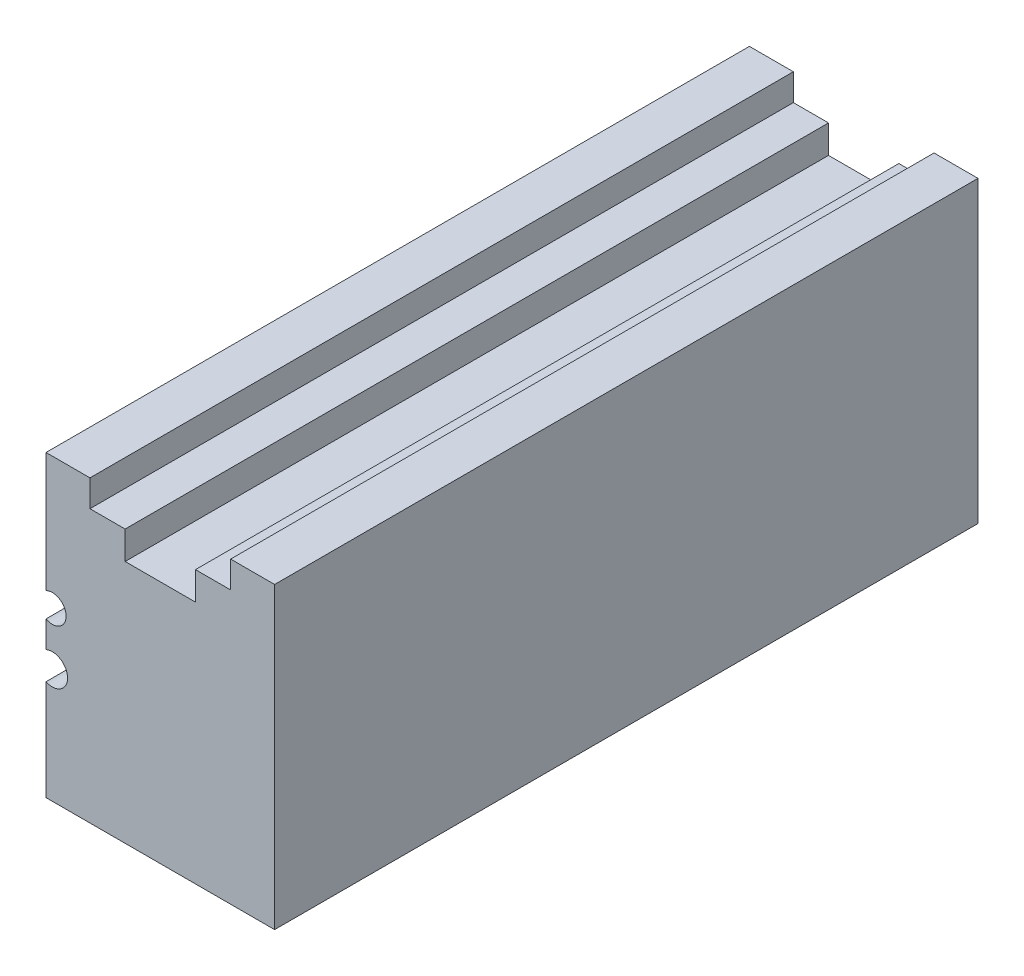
ISO-10303-21;
HEADER;
FILE_DESCRIPTION(('STEP AP214'),'2;1');
FILE_NAME('part.step','',(''),(''),'','','');
FILE_SCHEMA(('AUTOMOTIVE_DESIGN { 1 0 10303 214 1 1 1 1 }'));
ENDSEC;
DATA;
#1=APPLICATION_CONTEXT('core data for automotive mechanical design processes');
#2=APPLICATION_PROTOCOL_DEFINITION('international standard','automotive_design',2000,#1);
#3=PRODUCT_CONTEXT('',#1,'mechanical');
#4=PRODUCT('Part','Part','',(#3));
#5=PRODUCT_RELATED_PRODUCT_CATEGORY('part','',(#4));
#6=PRODUCT_DEFINITION_FORMATION('','',#4);
#7=PRODUCT_DEFINITION_CONTEXT('part definition',#1,'design');
#8=PRODUCT_DEFINITION('design','',#6,#7);
#9=PRODUCT_DEFINITION_SHAPE('','',#8);
#10=(LENGTH_UNIT() NAMED_UNIT(*) SI_UNIT(.MILLI.,.METRE.));
#11=(NAMED_UNIT(*) PLANE_ANGLE_UNIT() SI_UNIT($,.RADIAN.));
#12=(NAMED_UNIT(*) SI_UNIT($,.STERADIAN.) SOLID_ANGLE_UNIT());
#13=UNCERTAINTY_MEASURE_WITH_UNIT(LENGTH_MEASURE(1.E-05),#10,'distance_accuracy_value','');
#14=(GEOMETRIC_REPRESENTATION_CONTEXT(3) GLOBAL_UNCERTAINTY_ASSIGNED_CONTEXT((#13)) GLOBAL_UNIT_ASSIGNED_CONTEXT((#10,
#11,#12)) REPRESENTATION_CONTEXT('',''));
#15=CARTESIAN_POINT('',(0.,0.,0.));
#16=DIRECTION('',(0.,0.,1.));
#17=DIRECTION('',(1.,0.,0.));
#18=AXIS2_PLACEMENT_3D('',#15,#16,#17);
#19=CARTESIAN_POINT('',(0.,53.975,-127.));
#20=DIRECTION('',(0.,1.,0.));
#21=DIRECTION('',(0.,0.,1.));
#22=AXIS2_PLACEMENT_3D('',#19,#20,#21);
#23=PLANE('',#22);
#24=DIRECTION('',(0.,0.,1.));
#25=VECTOR('',#24,1.);
#26=CARTESIAN_POINT('',(7.9375,53.975,-127.));
#27=LINE('',#26,#25);
#28=CARTESIAN_POINT('',(7.9375,53.975,-127.));
#29=VERTEX_POINT('',#28);
#30=CARTESIAN_POINT('',(7.9375,53.975,0.));
#31=VERTEX_POINT('',#30);
#32=EDGE_CURVE('E373',#29,#31,#27,.T.);
#33=ORIENTED_EDGE('',*,*,#32,.F.);
#34=DIRECTION('',(-1.,0.,0.));
#35=VECTOR('',#34,1.);
#36=CARTESIAN_POINT('',(0.,53.975,-127.));
#37=LINE('',#36,#35);
#38=CARTESIAN_POINT('',(0.,53.975,-127.));
#39=VERTEX_POINT('',#38);
#40=EDGE_CURVE('E412',#29,#39,#37,.T.);
#41=ORIENTED_EDGE('',*,*,#40,.T.);
#42=DIRECTION('',(0.,0.,1.));
#43=VECTOR('',#42,1.);
#44=CARTESIAN_POINT('',(0.,53.975,-127.));
#45=LINE('',#44,#43);
#46=CARTESIAN_POINT('',(0.,53.975,0.));
#47=VERTEX_POINT('',#46);
#48=EDGE_CURVE('E435',#39,#47,#45,.T.);
#49=ORIENTED_EDGE('',*,*,#48,.T.);
#50=DIRECTION('',(-1.,0.,0.));
#51=VECTOR('',#50,1.);
#52=CARTESIAN_POINT('',(0.,53.975,0.));
#53=LINE('',#52,#51);
#54=EDGE_CURVE('E431',#31,#47,#53,.T.);
#55=ORIENTED_EDGE('',*,*,#54,.F.);
#56=EDGE_LOOP('',(#33,#41,#49,#55));
#57=FACE_BOUND('',#56,.T.);
#58=ADVANCED_FACE('F42',(#57),#23,.T.);
#59=CARTESIAN_POINT('',(0.,0.,-127.));
#60=DIRECTION('',(-1.,0.,0.));
#61=DIRECTION('',(0.,0.,1.));
#62=AXIS2_PLACEMENT_3D('',#59,#60,#61);
#63=PLANE('',#62);
#64=CARTESIAN_POINT('',(0.,11.938,-120.015));
#65=DIRECTION('',(-1.,0.,0.));
#66=DIRECTION('',(0.,0.,1.));
#67=AXIS2_PLACEMENT_3D('',#64,#65,#66);
#68=CIRCLE('',#67,3.048);
#69=CARTESIAN_POINT('',(0.,11.938,-116.967));
#70=VERTEX_POINT('',#69);
#71=EDGE_CURVE('E198',#70,#70,#68,.T.);
#72=ORIENTED_EDGE('',*,*,#71,.F.);
#73=EDGE_LOOP('',(#72));
#74=FACE_BOUND('',#73,.T.);
#75=CARTESIAN_POINT('',(0.,11.938,-6.985));
#76=DIRECTION('',(-1.,0.,0.));
#77=DIRECTION('',(0.,0.,1.));
#78=AXIS2_PLACEMENT_3D('',#75,#76,#77);
#79=CIRCLE('',#78,3.048);
#80=CARTESIAN_POINT('',(0.,11.938,-3.937));
#81=VERTEX_POINT('',#80);
#82=EDGE_CURVE('E188',#81,#81,#79,.T.);
#83=ORIENTED_EDGE('',*,*,#82,.F.);
#84=EDGE_LOOP('',(#83));
#85=FACE_BOUND('',#84,.T.);
#86=CARTESIAN_POINT('',(0.,44.069,-63.5));
#87=DIRECTION('',(-1.,0.,0.));
#88=DIRECTION('',(0.,0.,1.));
#89=AXIS2_PLACEMENT_3D('',#86,#87,#88);
#90=CIRCLE('',#89,3.048);
#91=CARTESIAN_POINT('',(0.,44.069,-60.452));
#92=VERTEX_POINT('',#91);
#93=EDGE_CURVE('E209',#92,#92,#90,.T.);
#94=ORIENTED_EDGE('',*,*,#93,.F.);
#95=EDGE_LOOP('',(#94));
#96=FACE_BOUND('',#95,.T.);
#97=DIRECTION('',(0.,0.,1.));
#98=VECTOR('',#97,1.);
#99=CARTESIAN_POINT('',(0.,18.1303508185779,-50.8));
#100=LINE('',#99,#98);
#101=CARTESIAN_POINT('',(0.,18.1303508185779,-50.8));
#102=VERTEX_POINT('',#101);
#103=CARTESIAN_POINT('',(0.,18.1303508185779,0.));
#104=VERTEX_POINT('',#103);
#105=EDGE_CURVE('E58',#102,#104,#100,.T.);
#106=ORIENTED_EDGE('',*,*,#105,.F.);
#107=DIRECTION('',(0.,1.,0.));
#108=VECTOR('',#107,1.);
#109=CARTESIAN_POINT('',(0.,0.,-50.8));
#110=LINE('',#109,#108);
#111=CARTESIAN_POINT('',(0.,23.1446491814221,-50.8));
#112=VERTEX_POINT('',#111);
#113=EDGE_CURVE('E11',#102,#112,#110,.T.);
#114=ORIENTED_EDGE('',*,*,#113,.T.);
#115=DIRECTION('',(0.,0.,1.));
#116=VECTOR('',#115,1.);
#117=CARTESIAN_POINT('',(0.,23.1446491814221,-50.8));
#118=LINE('',#117,#116);
#119=CARTESIAN_POINT('',(0.,23.1446491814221,0.));
#120=VERTEX_POINT('',#119);
#121=EDGE_CURVE('E225',#120,#112,#118,.F.);
#122=ORIENTED_EDGE('',*,*,#121,.F.);
#123=DIRECTION('',(0.,-1.,0.));
#124=VECTOR('',#123,1.);
#125=CARTESIAN_POINT('',(0.,0.,0.));
#126=LINE('',#125,#124);
#127=CARTESIAN_POINT('',(0.,27.9508709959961,0.));
#128=VERTEX_POINT('',#127);
#129=EDGE_CURVE('E423',#128,#120,#126,.T.);
#130=ORIENTED_EDGE('',*,*,#129,.F.);
#131=DIRECTION('',(0.,0.,1.));
#132=VECTOR('',#131,1.);
#133=CARTESIAN_POINT('',(0.,27.9508709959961,-50.8));
#134=LINE('',#133,#132);
#135=CARTESIAN_POINT('',(0.,27.9508709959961,-50.8));
#136=VERTEX_POINT('',#135);
#137=EDGE_CURVE('E66',#136,#128,#134,.T.);
#138=ORIENTED_EDGE('',*,*,#137,.F.);
#139=DIRECTION('',(0.,1.,0.));
#140=VECTOR('',#139,1.);
#141=CARTESIAN_POINT('',(0.,0.,-50.8));
#142=LINE('',#141,#140);
#143=CARTESIAN_POINT('',(0.,32.3741290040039,-50.8));
#144=VERTEX_POINT('',#143);
#145=EDGE_CURVE('E451',#136,#144,#142,.T.);
#146=ORIENTED_EDGE('',*,*,#145,.T.);
#147=DIRECTION('',(0.,0.,1.));
#148=VECTOR('',#147,1.);
#149=CARTESIAN_POINT('',(0.,32.3741290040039,-50.8));
#150=LINE('',#149,#148);
#151=CARTESIAN_POINT('',(0.,32.3741290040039,0.));
#152=VERTEX_POINT('',#151);
#153=EDGE_CURVE('E234',#152,#144,#150,.F.);
#154=ORIENTED_EDGE('',*,*,#153,.F.);
#155=EDGE_CURVE('E418',#47,#152,#126,.T.);
#156=ORIENTED_EDGE('',*,*,#155,.F.);
#157=ORIENTED_EDGE('',*,*,#48,.F.);
#158=DIRECTION('',(0.,-1.,0.));
#159=VECTOR('',#158,1.);
#160=CARTESIAN_POINT('',(0.,0.,-127.));
#161=LINE('',#160,#159);
#162=CARTESIAN_POINT('',(0.,0.,-127.));
#163=VERTEX_POINT('',#162);
#164=EDGE_CURVE('E399',#39,#163,#161,.T.);
#165=ORIENTED_EDGE('',*,*,#164,.T.);
#166=DIRECTION('',(0.,0.,1.));
#167=VECTOR('',#166,1.);
#168=CARTESIAN_POINT('',(0.,0.,-127.));
#169=LINE('',#168,#167);
#170=CARTESIAN_POINT('',(0.,0.,0.));
#171=VERTEX_POINT('',#170);
#172=EDGE_CURVE('E417',#163,#171,#169,.T.);
#173=ORIENTED_EDGE('',*,*,#172,.T.);
#174=EDGE_CURVE('E376',#104,#171,#126,.T.);
#175=ORIENTED_EDGE('',*,*,#174,.F.);
#176=EDGE_LOOP('',(#106,#114,#122,#130,#138,#146,#154,#156,#157,#165,#173,#175));
#177=FACE_BOUND('',#176,.T.);
#178=ADVANCED_FACE('F44',(#74,#85,#96,#177),#63,.T.);
#179=DIRECTION('',(0.,0.,1.));
#180=VECTOR('',#179,1.);
#181=CARTESIAN_POINT('',(33.3375,53.975,-127.));
#182=LINE('',#181,#180);
#183=CARTESIAN_POINT('',(33.3375,53.975,-127.));
#184=VERTEX_POINT('',#183);
#185=CARTESIAN_POINT('',(33.3375,53.975,0.));
#186=VERTEX_POINT('',#185);
#187=EDGE_CURVE('E377',#184,#186,#182,.T.);
#188=ORIENTED_EDGE('',*,*,#187,.T.);
#189=CARTESIAN_POINT('',(41.275,53.975,0.));
#190=VERTEX_POINT('',#189);
#191=EDGE_CURVE('E404',#190,#186,#53,.T.);
#192=ORIENTED_EDGE('',*,*,#191,.F.);
#193=DIRECTION('',(0.,0.,1.));
#194=VECTOR('',#193,1.);
#195=CARTESIAN_POINT('',(41.275,53.975,-127.));
#196=LINE('',#195,#194);
#197=CARTESIAN_POINT('',(41.275,53.975,-127.));
#198=VERTEX_POINT('',#197);
#199=EDGE_CURVE('E440',#198,#190,#196,.T.);
#200=ORIENTED_EDGE('',*,*,#199,.F.);
#201=EDGE_CURVE('E413',#198,#184,#37,.T.);
#202=ORIENTED_EDGE('',*,*,#201,.T.);
#203=EDGE_LOOP('',(#188,#192,#200,#202));
#204=FACE_BOUND('',#203,.T.);
#205=ADVANCED_FACE('F493',(#204),#23,.T.);
#206=CARTESIAN_POINT('',(41.275,0.,-127.));
#207=DIRECTION('',(1.,0.,0.));
#208=DIRECTION('',(0.,0.,-1.));
#209=AXIS2_PLACEMENT_3D('',#206,#207,#208);
#210=PLANE('',#209);
#211=DIRECTION('',(0.,1.,0.));
#212=VECTOR('',#211,1.);
#213=CARTESIAN_POINT('',(41.275,0.,0.));
#214=LINE('',#213,#212);
#215=CARTESIAN_POINT('',(41.275,0.,0.));
#216=VERTEX_POINT('',#215);
#217=EDGE_CURVE('E427',#216,#190,#214,.T.);
#218=ORIENTED_EDGE('',*,*,#217,.F.);
#219=DIRECTION('',(0.,0.,1.));
#220=VECTOR('',#219,1.);
#221=CARTESIAN_POINT('',(41.275,0.,-127.));
#222=LINE('',#221,#220);
#223=CARTESIAN_POINT('',(41.275,0.,-127.));
#224=VERTEX_POINT('',#223);
#225=EDGE_CURVE('E443',#224,#216,#222,.T.);
#226=ORIENTED_EDGE('',*,*,#225,.F.);
#227=DIRECTION('',(0.,1.,0.));
#228=VECTOR('',#227,1.);
#229=CARTESIAN_POINT('',(41.275,0.,-127.));
#230=LINE('',#229,#228);
#231=EDGE_CURVE('E408',#224,#198,#230,.T.);
#232=ORIENTED_EDGE('',*,*,#231,.T.);
#233=ORIENTED_EDGE('',*,*,#199,.T.);
#234=EDGE_LOOP('',(#218,#226,#232,#233));
#235=FACE_BOUND('',#234,.T.);
#236=ADVANCED_FACE('F501',(#235),#210,.T.);
#237=CARTESIAN_POINT('',(0.,0.,-127.));
#238=DIRECTION('',(0.,-1.,0.));
#239=DIRECTION('',(0.,0.,-1.));
#240=AXIS2_PLACEMENT_3D('',#237,#238,#239);
#241=PLANE('',#240);
#242=CARTESIAN_POINT('',(4.7625,0.,-38.1));
#243=DIRECTION('',(0.,-1.,0.));
#244=DIRECTION('',(0.,0.,-1.));
#245=AXIS2_PLACEMENT_3D('',#242,#243,#244);
#246=CIRCLE('',#245,3.81);
#247=CARTESIAN_POINT('',(4.7625,0.,-41.91));
#248=VERTEX_POINT('',#247);
#249=EDGE_CURVE('E239',#248,#248,#246,.T.);
#250=ORIENTED_EDGE('',*,*,#249,.F.);
#251=EDGE_LOOP('',(#250));
#252=FACE_BOUND('',#251,.T.);
#253=CARTESIAN_POINT('',(36.5125,0.,-38.1));
#254=DIRECTION('',(0.,-1.,0.));
#255=DIRECTION('',(0.,0.,-1.));
#256=AXIS2_PLACEMENT_3D('',#253,#254,#255);
#257=CIRCLE('',#256,3.81);
#258=CARTESIAN_POINT('',(36.5125,0.,-41.91));
#259=VERTEX_POINT('',#258);
#260=EDGE_CURVE('E251',#259,#259,#257,.T.);
#261=ORIENTED_EDGE('',*,*,#260,.F.);
#262=EDGE_LOOP('',(#261));
#263=FACE_BOUND('',#262,.T.);
#264=CARTESIAN_POINT('',(36.5125,0.,-88.9));
#265=DIRECTION('',(0.,-1.,0.));
#266=DIRECTION('',(0.,0.,-1.));
#267=AXIS2_PLACEMENT_3D('',#264,#265,#266);
#268=CIRCLE('',#267,3.81);
#269=CARTESIAN_POINT('',(36.5125,0.,-92.71));
#270=VERTEX_POINT('',#269);
#271=EDGE_CURVE('E263',#270,#270,#268,.T.);
#272=ORIENTED_EDGE('',*,*,#271,.F.);
#273=EDGE_LOOP('',(#272));
#274=FACE_BOUND('',#273,.T.);
#275=CARTESIAN_POINT('',(4.7625,0.,-88.9));
#276=DIRECTION('',(0.,-1.,0.));
#277=DIRECTION('',(0.,0.,-1.));
#278=AXIS2_PLACEMENT_3D('',#275,#276,#277);
#279=CIRCLE('',#278,3.81);
#280=CARTESIAN_POINT('',(4.7625,0.,-92.71));
#281=VERTEX_POINT('',#280);
#282=EDGE_CURVE('E275',#281,#281,#279,.T.);
#283=ORIENTED_EDGE('',*,*,#282,.F.);
#284=EDGE_LOOP('',(#283));
#285=FACE_BOUND('',#284,.T.);
#286=CARTESIAN_POINT('',(4.7625,0.,-63.5));
#287=DIRECTION('',(0.,-1.,0.));
#288=DIRECTION('',(0.,0.,-1.));
#289=AXIS2_PLACEMENT_3D('',#286,#287,#288);
#290=CIRCLE('',#289,2.413);
#291=CARTESIAN_POINT('',(4.7625,0.,-65.913));
#292=VERTEX_POINT('',#291);
#293=EDGE_CURVE('E293',#292,#292,#290,.T.);
#294=ORIENTED_EDGE('',*,*,#293,.F.);
#295=EDGE_LOOP('',(#294));
#296=FACE_BOUND('',#295,.T.);
#297=CARTESIAN_POINT('',(36.5125,0.,-63.5));
#298=DIRECTION('',(0.,-1.,0.));
#299=DIRECTION('',(0.,0.,-1.));
#300=AXIS2_PLACEMENT_3D('',#297,#298,#299);
#301=CIRCLE('',#300,2.41299999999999);
#302=CARTESIAN_POINT('',(36.5125,0.,-65.913));
#303=VERTEX_POINT('',#302);
#304=EDGE_CURVE('E301',#303,#303,#301,.T.);
#305=ORIENTED_EDGE('',*,*,#304,.F.);
#306=EDGE_LOOP('',(#305));
#307=FACE_BOUND('',#306,.T.);
#308=CARTESIAN_POINT('',(20.6375,0.,-101.6));
#309=DIRECTION('',(0.,-1.,0.));
#310=DIRECTION('',(0.,0.,-1.));
#311=AXIS2_PLACEMENT_3D('',#308,#309,#310);
#312=CIRCLE('',#311,2.413);
#313=CARTESIAN_POINT('',(20.6375,0.,-104.013));
#314=VERTEX_POINT('',#313);
#315=EDGE_CURVE('E287',#314,#314,#312,.T.);
#316=ORIENTED_EDGE('',*,*,#315,.F.);
#317=EDGE_LOOP('',(#316));
#318=FACE_BOUND('',#317,.T.);
#319=CARTESIAN_POINT('',(20.6375,0.,-25.4));
#320=DIRECTION('',(0.,-1.,0.));
#321=DIRECTION('',(0.,0.,-1.));
#322=AXIS2_PLACEMENT_3D('',#319,#320,#321);
#323=CIRCLE('',#322,2.413);
#324=CARTESIAN_POINT('',(20.6375,0.,-27.813));
#325=VERTEX_POINT('',#324);
#326=EDGE_CURVE('E292',#325,#325,#323,.T.);
#327=ORIENTED_EDGE('',*,*,#326,.F.);
#328=EDGE_LOOP('',(#327));
#329=FACE_BOUND('',#328,.T.);
#330=DIRECTION('',(1.,0.,0.));
#331=VECTOR('',#330,1.);
#332=CARTESIAN_POINT('',(0.,0.,0.));
#333=LINE('',#332,#331);
#334=EDGE_CURVE('E422',#171,#216,#333,.T.);
#335=ORIENTED_EDGE('',*,*,#334,.F.);
#336=ORIENTED_EDGE('',*,*,#172,.F.);
#337=DIRECTION('',(1.,0.,0.));
#338=VECTOR('',#337,1.);
#339=CARTESIAN_POINT('',(0.,0.,-127.));
#340=LINE('',#339,#338);
#341=EDGE_CURVE('E403',#163,#224,#340,.T.);
#342=ORIENTED_EDGE('',*,*,#341,.T.);
#343=ORIENTED_EDGE('',*,*,#225,.T.);
#344=EDGE_LOOP('',(#335,#336,#342,#343));
#345=FACE_BOUND('',#344,.T.);
#346=ADVANCED_FACE('F506',(#252,#263,#274,#285,#296,#307,#318,#329,#345),#241,.T.);
#347=CARTESIAN_POINT('',(0.,0.,-127.));
#348=DIRECTION('',(0.,0.,-1.));
#349=DIRECTION('',(-1.,0.,0.));
#350=AXIS2_PLACEMENT_3D('',#347,#348,#349);
#351=PLANE('',#350);
#352=DIRECTION('',(0.,-1.,0.));
#353=VECTOR('',#352,1.);
#354=CARTESIAN_POINT('',(7.9375,53.975,-127.));
#355=LINE('',#354,#353);
#356=CARTESIAN_POINT('',(7.9375,49.149,-127.));
#357=VERTEX_POINT('',#356);
#358=EDGE_CURVE('E320',#29,#357,#355,.T.);
#359=ORIENTED_EDGE('',*,*,#358,.T.);
#360=DIRECTION('',(1.,0.,0.));
#361=VECTOR('',#360,1.);
#362=CARTESIAN_POINT('',(7.9375,49.149,-127.));
#363=LINE('',#362,#361);
#364=CARTESIAN_POINT('',(14.2875,49.149,-127.));
#365=VERTEX_POINT('',#364);
#366=EDGE_CURVE('E324',#357,#365,#363,.T.);
#367=ORIENTED_EDGE('',*,*,#366,.T.);
#368=DIRECTION('',(0.,-1.,0.));
#369=VECTOR('',#368,1.);
#370=CARTESIAN_POINT('',(14.2875,49.149,-127.));
#371=LINE('',#370,#369);
#372=CARTESIAN_POINT('',(14.2875,44.069,-127.));
#373=VERTEX_POINT('',#372);
#374=EDGE_CURVE('E329',#365,#373,#371,.T.);
#375=ORIENTED_EDGE('',*,*,#374,.T.);
#376=DIRECTION('',(1.,0.,0.));
#377=VECTOR('',#376,1.);
#378=CARTESIAN_POINT('',(14.2875,44.069,-127.));
#379=LINE('',#378,#377);
#380=CARTESIAN_POINT('',(26.9875,44.069,-127.));
#381=VERTEX_POINT('',#380);
#382=EDGE_CURVE('E333',#373,#381,#379,.T.);
#383=ORIENTED_EDGE('',*,*,#382,.T.);
#384=DIRECTION('',(0.,1.,0.));
#385=VECTOR('',#384,1.);
#386=CARTESIAN_POINT('',(26.9875,49.149,-127.));
#387=LINE('',#386,#385);
#388=CARTESIAN_POINT('',(26.9875,49.149,-127.));
#389=VERTEX_POINT('',#388);
#390=EDGE_CURVE('E337',#381,#389,#387,.T.);
#391=ORIENTED_EDGE('',*,*,#390,.T.);
#392=DIRECTION('',(1.,0.,0.));
#393=VECTOR('',#392,1.);
#394=CARTESIAN_POINT('',(26.9875,49.149,-127.));
#395=LINE('',#394,#393);
#396=CARTESIAN_POINT('',(33.3375,49.149,-127.));
#397=VERTEX_POINT('',#396);
#398=EDGE_CURVE('E341',#389,#397,#395,.T.);
#399=ORIENTED_EDGE('',*,*,#398,.T.);
#400=DIRECTION('',(0.,1.,0.));
#401=VECTOR('',#400,1.);
#402=CARTESIAN_POINT('',(33.3375,53.975,-127.));
#403=LINE('',#402,#401);
#404=EDGE_CURVE('E345',#397,#184,#403,.T.);
#405=ORIENTED_EDGE('',*,*,#404,.T.);
#406=ORIENTED_EDGE('',*,*,#201,.F.);
#407=ORIENTED_EDGE('',*,*,#231,.F.);
#408=ORIENTED_EDGE('',*,*,#341,.F.);
#409=ORIENTED_EDGE('',*,*,#164,.F.);
#410=ORIENTED_EDGE('',*,*,#40,.F.);
#411=EDGE_LOOP('',(#359,#367,#375,#383,#391,#399,#405,#406,#407,#408,#409,#410));
#412=FACE_BOUND('',#411,.T.);
#413=ADVANCED_FACE('F518',(#412),#351,.T.);
#414=CARTESIAN_POINT('',(0.,0.,0.));
#415=DIRECTION('',(0.,0.,-1.));
#416=DIRECTION('',(-1.,0.,0.));
#417=AXIS2_PLACEMENT_3D('',#414,#415,#416);
#418=PLANE('',#417);
#419=ORIENTED_EDGE('',*,*,#129,.T.);
#420=CARTESIAN_POINT('',(1.143,20.6375,0.));
#421=DIRECTION('',(0.,0.,-1.));
#422=DIRECTION('',(-1.,0.,0.));
#423=AXIS2_PLACEMENT_3D('',#420,#421,#422);
#424=CIRCLE('',#423,2.75540305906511);
#425=EDGE_CURVE('E51',#120,#104,#424,.T.);
#426=ORIENTED_EDGE('',*,*,#425,.T.);
#427=ORIENTED_EDGE('',*,*,#174,.T.);
#428=ORIENTED_EDGE('',*,*,#334,.T.);
#429=ORIENTED_EDGE('',*,*,#217,.T.);
#430=ORIENTED_EDGE('',*,*,#191,.T.);
#431=DIRECTION('',(0.,1.,0.));
#432=VECTOR('',#431,1.);
#433=CARTESIAN_POINT('',(33.3375,53.975,0.));
#434=LINE('',#433,#432);
#435=CARTESIAN_POINT('',(33.3375,49.149,0.));
#436=VERTEX_POINT('',#435);
#437=EDGE_CURVE('E325',#436,#186,#434,.T.);
#438=ORIENTED_EDGE('',*,*,#437,.F.);
#439=DIRECTION('',(1.,0.,0.));
#440=VECTOR('',#439,1.);
#441=CARTESIAN_POINT('',(26.9875,49.149,0.));
#442=LINE('',#441,#440);
#443=CARTESIAN_POINT('',(26.9875,49.149,0.));
#444=VERTEX_POINT('',#443);
#445=EDGE_CURVE('E367',#444,#436,#442,.T.);
#446=ORIENTED_EDGE('',*,*,#445,.F.);
#447=DIRECTION('',(0.,1.,0.));
#448=VECTOR('',#447,1.);
#449=CARTESIAN_POINT('',(26.9875,49.149,0.));
#450=LINE('',#449,#448);
#451=CARTESIAN_POINT('',(26.9875,44.069,0.));
#452=VERTEX_POINT('',#451);
#453=EDGE_CURVE('E363',#452,#444,#450,.T.);
#454=ORIENTED_EDGE('',*,*,#453,.F.);
#455=DIRECTION('',(1.,0.,0.));
#456=VECTOR('',#455,1.);
#457=CARTESIAN_POINT('',(14.2875,44.069,0.));
#458=LINE('',#457,#456);
#459=CARTESIAN_POINT('',(14.2875,44.069,0.));
#460=VERTEX_POINT('',#459);
#461=EDGE_CURVE('E360',#460,#452,#458,.T.);
#462=ORIENTED_EDGE('',*,*,#461,.F.);
#463=DIRECTION('',(0.,-1.,0.));
#464=VECTOR('',#463,1.);
#465=CARTESIAN_POINT('',(14.2875,49.149,0.));
#466=LINE('',#465,#464);
#467=CARTESIAN_POINT('',(14.2875,49.149,0.));
#468=VERTEX_POINT('',#467);
#469=EDGE_CURVE('E356',#468,#460,#466,.T.);
#470=ORIENTED_EDGE('',*,*,#469,.F.);
#471=DIRECTION('',(1.,0.,0.));
#472=VECTOR('',#471,1.);
#473=CARTESIAN_POINT('',(7.9375,49.149,0.));
#474=LINE('',#473,#472);
#475=CARTESIAN_POINT('',(7.9375,49.149,0.));
#476=VERTEX_POINT('',#475);
#477=EDGE_CURVE('E352',#476,#468,#474,.T.);
#478=ORIENTED_EDGE('',*,*,#477,.F.);
#479=DIRECTION('',(0.,-1.,0.));
#480=VECTOR('',#479,1.);
#481=CARTESIAN_POINT('',(7.9375,53.975,0.));
#482=LINE('',#481,#480);
#483=EDGE_CURVE('E316',#31,#476,#482,.T.);
#484=ORIENTED_EDGE('',*,*,#483,.F.);
#485=ORIENTED_EDGE('',*,*,#54,.T.);
#486=ORIENTED_EDGE('',*,*,#155,.T.);
#487=CARTESIAN_POINT('',(1.143,30.1625,0.));
#488=DIRECTION('',(0.,0.,-1.));
#489=DIRECTION('',(-1.,0.,0.));
#490=AXIS2_PLACEMENT_3D('',#487,#488,#489);
#491=CIRCLE('',#490,2.48952843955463);
#492=EDGE_CURVE('E439',#152,#128,#491,.T.);
#493=ORIENTED_EDGE('',*,*,#492,.T.);
#494=EDGE_LOOP('',(#419,#426,#427,#428,#429,#430,#438,#446,#454,#462,#470,#478,#484,#485,#486,#493));
#495=FACE_BOUND('',#494,.T.);
#496=ADVANCED_FACE('F458',(#495),#418,.F.);
#497=CARTESIAN_POINT('',(7.9375,53.975,-127.));
#498=DIRECTION('',(-1.,0.,0.));
#499=DIRECTION('',(0.,0.,1.));
#500=AXIS2_PLACEMENT_3D('',#497,#498,#499);
#501=PLANE('',#500);
#502=ORIENTED_EDGE('',*,*,#483,.T.);
#503=DIRECTION('',(0.,0.,1.));
#504=VECTOR('',#503,1.);
#505=CARTESIAN_POINT('',(7.9375,49.149,-127.));
#506=LINE('',#505,#504);
#507=EDGE_CURVE('E349',#357,#476,#506,.T.);
#508=ORIENTED_EDGE('',*,*,#507,.F.);
#509=ORIENTED_EDGE('',*,*,#358,.F.);
#510=ORIENTED_EDGE('',*,*,#32,.T.);
#511=EDGE_LOOP('',(#502,#508,#509,#510));
#512=FACE_BOUND('',#511,.T.);
#513=ADVANCED_FACE('F539',(#512),#501,.F.);
#514=CARTESIAN_POINT('',(33.3375,53.975,-127.));
#515=DIRECTION('',(1.,0.,0.));
#516=DIRECTION('',(0.,0.,-1.));
#517=AXIS2_PLACEMENT_3D('',#514,#515,#516);
#518=PLANE('',#517);
#519=ORIENTED_EDGE('',*,*,#437,.T.);
#520=ORIENTED_EDGE('',*,*,#187,.F.);
#521=ORIENTED_EDGE('',*,*,#404,.F.);
#522=DIRECTION('',(0.,0.,1.));
#523=VECTOR('',#522,1.);
#524=CARTESIAN_POINT('',(33.3375,49.149,-127.));
#525=LINE('',#524,#523);
#526=EDGE_CURVE('E381',#397,#436,#525,.T.);
#527=ORIENTED_EDGE('',*,*,#526,.T.);
#528=EDGE_LOOP('',(#519,#520,#521,#527));
#529=FACE_BOUND('',#528,.T.);
#530=ADVANCED_FACE('F520',(#529),#518,.F.);
#531=CARTESIAN_POINT('',(26.9875,49.149,-127.));
#532=DIRECTION('',(0.,-1.,0.));
#533=DIRECTION('',(0.,0.,-1.));
#534=AXIS2_PLACEMENT_3D('',#531,#532,#533);
#535=PLANE('',#534);
#536=ORIENTED_EDGE('',*,*,#445,.T.);
#537=ORIENTED_EDGE('',*,*,#526,.F.);
#538=ORIENTED_EDGE('',*,*,#398,.F.);
#539=DIRECTION('',(0.,0.,1.));
#540=VECTOR('',#539,1.);
#541=CARTESIAN_POINT('',(26.9875,49.149,-127.));
#542=LINE('',#541,#540);
#543=EDGE_CURVE('E384',#389,#444,#542,.T.);
#544=ORIENTED_EDGE('',*,*,#543,.T.);
#545=EDGE_LOOP('',(#536,#537,#538,#544));
#546=FACE_BOUND('',#545,.T.);
#547=ADVANCED_FACE('F522',(#546),#535,.F.);
#548=CARTESIAN_POINT('',(26.9875,49.149,-127.));
#549=DIRECTION('',(1.,0.,0.));
#550=DIRECTION('',(0.,0.,-1.));
#551=AXIS2_PLACEMENT_3D('',#548,#549,#550);
#552=PLANE('',#551);
#553=ORIENTED_EDGE('',*,*,#453,.T.);
#554=ORIENTED_EDGE('',*,*,#543,.F.);
#555=ORIENTED_EDGE('',*,*,#390,.F.);
#556=DIRECTION('',(0.,0.,1.));
#557=VECTOR('',#556,1.);
#558=CARTESIAN_POINT('',(26.9875,44.069,-127.));
#559=LINE('',#558,#557);
#560=EDGE_CURVE('E387',#381,#452,#559,.T.);
#561=ORIENTED_EDGE('',*,*,#560,.T.);
#562=EDGE_LOOP('',(#553,#554,#555,#561));
#563=FACE_BOUND('',#562,.T.);
#564=ADVANCED_FACE('F527',(#563),#552,.F.);
#565=CARTESIAN_POINT('',(14.2875,44.069,-127.));
#566=DIRECTION('',(0.,-1.,0.));
#567=DIRECTION('',(0.,0.,-1.));
#568=AXIS2_PLACEMENT_3D('',#565,#566,#567);
#569=PLANE('',#568);
#570=ORIENTED_EDGE('',*,*,#461,.T.);
#571=ORIENTED_EDGE('',*,*,#560,.F.);
#572=ORIENTED_EDGE('',*,*,#382,.F.);
#573=DIRECTION('',(0.,0.,1.));
#574=VECTOR('',#573,1.);
#575=CARTESIAN_POINT('',(14.2875,44.069,-127.));
#576=LINE('',#575,#574);
#577=EDGE_CURVE('E390',#373,#460,#576,.T.);
#578=ORIENTED_EDGE('',*,*,#577,.T.);
#579=EDGE_LOOP('',(#570,#571,#572,#578));
#580=FACE_BOUND('',#579,.T.);
#581=ADVANCED_FACE('F531',(#580),#569,.F.);
#582=CARTESIAN_POINT('',(14.2875,49.149,-127.));
#583=DIRECTION('',(-1.,0.,0.));
#584=DIRECTION('',(0.,0.,1.));
#585=AXIS2_PLACEMENT_3D('',#582,#583,#584);
#586=PLANE('',#585);
#587=ORIENTED_EDGE('',*,*,#469,.T.);
#588=ORIENTED_EDGE('',*,*,#577,.F.);
#589=ORIENTED_EDGE('',*,*,#374,.F.);
#590=DIRECTION('',(0.,0.,1.));
#591=VECTOR('',#590,1.);
#592=CARTESIAN_POINT('',(14.2875,49.149,-127.));
#593=LINE('',#592,#591);
#594=EDGE_CURVE('E393',#365,#468,#593,.T.);
#595=ORIENTED_EDGE('',*,*,#594,.T.);
#596=EDGE_LOOP('',(#587,#588,#589,#595));
#597=FACE_BOUND('',#596,.T.);
#598=ADVANCED_FACE('F534',(#597),#586,.F.);
#599=CARTESIAN_POINT('',(7.9375,49.149,-127.));
#600=DIRECTION('',(0.,-1.,0.));
#601=DIRECTION('',(1.,0.,0.));
#602=AXIS2_PLACEMENT_3D('',#599,#600,#601);
#603=PLANE('',#602);
#604=ORIENTED_EDGE('',*,*,#477,.T.);
#605=ORIENTED_EDGE('',*,*,#594,.F.);
#606=ORIENTED_EDGE('',*,*,#366,.F.);
#607=ORIENTED_EDGE('',*,*,#507,.T.);
#608=EDGE_LOOP('',(#604,#605,#606,#607));
#609=FACE_BOUND('',#608,.T.);
#610=ADVANCED_FACE('F536',(#609),#603,.F.);
#611=CARTESIAN_POINT('',(20.6375,6.35,-25.4));
#612=DIRECTION('',(0.,-1.,0.));
#613=DIRECTION('',(0.,0.,-1.));
#614=AXIS2_PLACEMENT_3D('',#611,#612,#613);
#615=CYLINDRICAL_SURFACE('',#614,2.413);
#616=CARTESIAN_POINT('',(20.6375,6.35,-25.4));
#617=DIRECTION('',(0.,-1.,0.));
#618=DIRECTION('',(0.,0.,-1.));
#619=AXIS2_PLACEMENT_3D('',#616,#617,#618);
#620=CIRCLE('',#619,2.413);
#621=CARTESIAN_POINT('',(20.6375,6.35,-27.813));
#622=VERTEX_POINT('',#621);
#623=EDGE_CURVE('E312',#622,#622,#620,.T.);
#624=ORIENTED_EDGE('',*,*,#623,.F.);
#625=EDGE_LOOP('',(#624));
#626=FACE_BOUND('',#625,.T.);
#627=ORIENTED_EDGE('',*,*,#326,.T.);
#628=EDGE_LOOP('',(#627));
#629=FACE_BOUND('',#628,.T.);
#630=ADVANCED_FACE('F563',(#626,#629),#615,.F.);
#631=CARTESIAN_POINT('',(20.6375,6.35,-25.4));
#632=DIRECTION('',(0.,-1.,0.));
#633=DIRECTION('',(0.,0.,-1.));
#634=AXIS2_PLACEMENT_3D('',#631,#632,#633);
#635=PLANE('',#634);
#636=ORIENTED_EDGE('',*,*,#623,.T.);
#637=EDGE_LOOP('',(#636));
#638=FACE_BOUND('',#637,.T.);
#639=ADVANCED_FACE('F565',(#638),#635,.T.);
#640=CARTESIAN_POINT('',(20.6375,6.35,-101.6));
#641=DIRECTION('',(0.,-1.,0.));
#642=DIRECTION('',(0.,0.,-1.));
#643=AXIS2_PLACEMENT_3D('',#640,#641,#642);
#644=CYLINDRICAL_SURFACE('',#643,2.413);
#645=CARTESIAN_POINT('',(20.6375,6.35,-101.6));
#646=DIRECTION('',(0.,-1.,0.));
#647=DIRECTION('',(0.,0.,-1.));
#648=AXIS2_PLACEMENT_3D('',#645,#646,#647);
#649=CIRCLE('',#648,2.413);
#650=CARTESIAN_POINT('',(20.6375,6.35,-104.013));
#651=VERTEX_POINT('',#650);
#652=EDGE_CURVE('E305',#651,#651,#649,.T.);
#653=ORIENTED_EDGE('',*,*,#652,.F.);
#654=EDGE_LOOP('',(#653));
#655=FACE_BOUND('',#654,.T.);
#656=ORIENTED_EDGE('',*,*,#315,.T.);
#657=EDGE_LOOP('',(#656));
#658=FACE_BOUND('',#657,.T.);
#659=ADVANCED_FACE('F572',(#655,#658),#644,.F.);
#660=CARTESIAN_POINT('',(20.6375,6.35,-101.6));
#661=DIRECTION('',(0.,-1.,0.));
#662=DIRECTION('',(0.,0.,-1.));
#663=AXIS2_PLACEMENT_3D('',#660,#661,#662);
#664=PLANE('',#663);
#665=ORIENTED_EDGE('',*,*,#652,.T.);
#666=EDGE_LOOP('',(#665));
#667=FACE_BOUND('',#666,.T.);
#668=ADVANCED_FACE('F631',(#667),#664,.T.);
#669=CARTESIAN_POINT('',(36.5125,6.35,-63.5));
#670=DIRECTION('',(0.,-1.,0.));
#671=DIRECTION('',(0.,0.,-1.));
#672=AXIS2_PLACEMENT_3D('',#669,#670,#671);
#673=CYLINDRICAL_SURFACE('',#672,2.41299999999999);
#674=CARTESIAN_POINT('',(36.5125,6.35,-63.5));
#675=DIRECTION('',(0.,-1.,0.));
#676=DIRECTION('',(0.,0.,-1.));
#677=AXIS2_PLACEMENT_3D('',#674,#675,#676);
#678=CIRCLE('',#677,2.41299999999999);
#679=CARTESIAN_POINT('',(36.5125,6.35,-65.913));
#680=VERTEX_POINT('',#679);
#681=EDGE_CURVE('E297',#680,#680,#678,.T.);
#682=ORIENTED_EDGE('',*,*,#681,.F.);
#683=EDGE_LOOP('',(#682));
#684=FACE_BOUND('',#683,.T.);
#685=ORIENTED_EDGE('',*,*,#304,.T.);
#686=EDGE_LOOP('',(#685));
#687=FACE_BOUND('',#686,.T.);
#688=ADVANCED_FACE('F639',(#684,#687),#673,.F.);
#689=CARTESIAN_POINT('',(36.5125,6.35,-63.5));
#690=DIRECTION('',(0.,-1.,0.));
#691=DIRECTION('',(0.,0.,-1.));
#692=AXIS2_PLACEMENT_3D('',#689,#690,#691);
#693=PLANE('',#692);
#694=ORIENTED_EDGE('',*,*,#681,.T.);
#695=EDGE_LOOP('',(#694));
#696=FACE_BOUND('',#695,.T.);
#697=ADVANCED_FACE('F648',(#696),#693,.T.);
#698=CARTESIAN_POINT('',(4.7625,6.35,-63.5));
#699=DIRECTION('',(0.,-1.,0.));
#700=DIRECTION('',(0.,0.,-1.));
#701=AXIS2_PLACEMENT_3D('',#698,#699,#700);
#702=CYLINDRICAL_SURFACE('',#701,2.413);
#703=CARTESIAN_POINT('',(4.7625,6.35,-63.5));
#704=DIRECTION('',(0.,-1.,0.));
#705=DIRECTION('',(0.,0.,-1.));
#706=AXIS2_PLACEMENT_3D('',#703,#704,#705);
#707=CIRCLE('',#706,2.413);
#708=CARTESIAN_POINT('',(4.7625,6.35,-65.913));
#709=VERTEX_POINT('',#708);
#710=EDGE_CURVE('E288',#709,#709,#707,.T.);
#711=ORIENTED_EDGE('',*,*,#710,.F.);
#712=EDGE_LOOP('',(#711));
#713=FACE_BOUND('',#712,.T.);
#714=ORIENTED_EDGE('',*,*,#293,.T.);
#715=EDGE_LOOP('',(#714));
#716=FACE_BOUND('',#715,.T.);
#717=ADVANCED_FACE('F657',(#713,#716),#702,.F.);
#718=CARTESIAN_POINT('',(4.7625,6.35,-63.5));
#719=DIRECTION('',(0.,-1.,0.));
#720=DIRECTION('',(0.,0.,-1.));
#721=AXIS2_PLACEMENT_3D('',#718,#719,#720);
#722=PLANE('',#721);
#723=ORIENTED_EDGE('',*,*,#710,.T.);
#724=EDGE_LOOP('',(#723));
#725=FACE_BOUND('',#724,.T.);
#726=ADVANCED_FACE('F666',(#725),#722,.T.);
#727=CARTESIAN_POINT('',(4.7625,11.43,-88.9));
#728=DIRECTION('',(0.,-1.,0.));
#729=DIRECTION('',(0.,0.,-1.));
#730=AXIS2_PLACEMENT_3D('',#727,#728,#729);
#731=CONICAL_SURFACE('',#730,2.5527,1.02974425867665);
#732=CARTESIAN_POINT('',(4.7625,12.9638169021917,-88.9));
#733=VERTEX_POINT('',#732);
#734=VERTEX_LOOP('',#733);
#735=FACE_BOUND('',#734,.T.);
#736=CARTESIAN_POINT('',(4.7625,11.43,-88.9));
#737=DIRECTION('',(0.,-1.,0.));
#738=DIRECTION('',(0.,0.,-1.));
#739=AXIS2_PLACEMENT_3D('',#736,#737,#738);
#740=CIRCLE('',#739,2.5527);
#741=CARTESIAN_POINT('',(4.7625,11.43,-91.4527));
#742=VERTEX_POINT('',#741);
#743=EDGE_CURVE('E283',#742,#742,#740,.T.);
#744=ORIENTED_EDGE('',*,*,#743,.T.);
#745=EDGE_LOOP('',(#744));
#746=FACE_BOUND('',#745,.T.);
#747=ADVANCED_FACE('F675',(#735,#746),#731,.F.);
#748=CARTESIAN_POINT('',(4.7625,0.,-88.9));
#749=DIRECTION('',(0.,-1.,0.));
#750=DIRECTION('',(0.,0.,-1.));
#751=AXIS2_PLACEMENT_3D('',#748,#749,#750);
#752=CYLINDRICAL_SURFACE('',#751,2.5527);
#753=ORIENTED_EDGE('',*,*,#743,.F.);
#754=EDGE_LOOP('',(#753));
#755=FACE_BOUND('',#754,.T.);
#756=CARTESIAN_POINT('',(4.7625,1.2573,-88.9));
#757=DIRECTION('',(0.,-1.,0.));
#758=DIRECTION('',(0.,0.,-1.));
#759=AXIS2_PLACEMENT_3D('',#756,#757,#758);
#760=CIRCLE('',#759,2.5527);
#761=CARTESIAN_POINT('',(4.7625,1.2573,-91.4527));
#762=VERTEX_POINT('',#761);
#763=EDGE_CURVE('E279',#762,#762,#760,.T.);
#764=ORIENTED_EDGE('',*,*,#763,.T.);
#765=EDGE_LOOP('',(#764));
#766=FACE_BOUND('',#765,.T.);
#767=ADVANCED_FACE('F685',(#755,#766),#752,.F.);
#768=CARTESIAN_POINT('',(4.7625,0.,-88.9));
#769=DIRECTION('',(0.,-1.,0.));
#770=DIRECTION('',(0.,0.,-1.));
#771=AXIS2_PLACEMENT_3D('',#768,#769,#770);
#772=CONICAL_SURFACE('',#771,3.81,0.785398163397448);
#773=ORIENTED_EDGE('',*,*,#763,.F.);
#774=EDGE_LOOP('',(#773));
#775=FACE_BOUND('',#774,.T.);
#776=ORIENTED_EDGE('',*,*,#282,.T.);
#777=EDGE_LOOP('',(#776));
#778=FACE_BOUND('',#777,.T.);
#779=ADVANCED_FACE('F695',(#775,#778),#772,.F.);
#780=CARTESIAN_POINT('',(36.5125,11.43,-88.9));
#781=DIRECTION('',(0.,-1.,0.));
#782=DIRECTION('',(0.,0.,-1.));
#783=AXIS2_PLACEMENT_3D('',#780,#781,#782);
#784=CONICAL_SURFACE('',#783,2.5527,1.02974425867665);
#785=CARTESIAN_POINT('',(36.5125,12.9638169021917,-88.9));
#786=VERTEX_POINT('',#785);
#787=VERTEX_LOOP('',#786);
#788=FACE_BOUND('',#787,.T.);
#789=CARTESIAN_POINT('',(36.5125,11.43,-88.9));
#790=DIRECTION('',(0.,-1.,0.));
#791=DIRECTION('',(0.,0.,-1.));
#792=AXIS2_PLACEMENT_3D('',#789,#790,#791);
#793=CIRCLE('',#792,2.5527);
#794=CARTESIAN_POINT('',(36.5125,11.43,-91.4527));
#795=VERTEX_POINT('',#794);
#796=EDGE_CURVE('E271',#795,#795,#793,.T.);
#797=ORIENTED_EDGE('',*,*,#796,.T.);
#798=EDGE_LOOP('',(#797));
#799=FACE_BOUND('',#798,.T.);
#800=ADVANCED_FACE('F705',(#788,#799),#784,.F.);
#801=CARTESIAN_POINT('',(36.5125,0.,-88.9));
#802=DIRECTION('',(0.,-1.,0.));
#803=DIRECTION('',(0.,0.,-1.));
#804=AXIS2_PLACEMENT_3D('',#801,#802,#803);
#805=CYLINDRICAL_SURFACE('',#804,2.5527);
#806=ORIENTED_EDGE('',*,*,#796,.F.);
#807=EDGE_LOOP('',(#806));
#808=FACE_BOUND('',#807,.T.);
#809=CARTESIAN_POINT('',(36.5125,1.2573,-88.9));
#810=DIRECTION('',(0.,-1.,0.));
#811=DIRECTION('',(0.,0.,-1.));
#812=AXIS2_PLACEMENT_3D('',#809,#810,#811);
#813=CIRCLE('',#812,2.5527);
#814=CARTESIAN_POINT('',(36.5125,1.2573,-91.4527));
#815=VERTEX_POINT('',#814);
#816=EDGE_CURVE('E267',#815,#815,#813,.T.);
#817=ORIENTED_EDGE('',*,*,#816,.T.);
#818=EDGE_LOOP('',(#817));
#819=FACE_BOUND('',#818,.T.);
#820=ADVANCED_FACE('F714',(#808,#819),#805,.F.);
#821=CARTESIAN_POINT('',(36.5125,0.,-88.9));
#822=DIRECTION('',(0.,-1.,0.));
#823=DIRECTION('',(0.,0.,-1.));
#824=AXIS2_PLACEMENT_3D('',#821,#822,#823);
#825=CONICAL_SURFACE('',#824,3.81,0.785398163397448);
#826=ORIENTED_EDGE('',*,*,#816,.F.);
#827=EDGE_LOOP('',(#826));
#828=FACE_BOUND('',#827,.T.);
#829=ORIENTED_EDGE('',*,*,#271,.T.);
#830=EDGE_LOOP('',(#829));
#831=FACE_BOUND('',#830,.T.);
#832=ADVANCED_FACE('F723',(#828,#831),#825,.F.);
#833=CARTESIAN_POINT('',(36.5125,11.43,-38.1));
#834=DIRECTION('',(0.,-1.,0.));
#835=DIRECTION('',(0.,0.,-1.));
#836=AXIS2_PLACEMENT_3D('',#833,#834,#835);
#837=CONICAL_SURFACE('',#836,2.5527,1.02974425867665);
#838=CARTESIAN_POINT('',(36.5125,12.9638169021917,-38.1));
#839=VERTEX_POINT('',#838);
#840=VERTEX_LOOP('',#839);
#841=FACE_BOUND('',#840,.T.);
#842=CARTESIAN_POINT('',(36.5125,11.43,-38.1));
#843=DIRECTION('',(0.,-1.,0.));
#844=DIRECTION('',(0.,0.,-1.));
#845=AXIS2_PLACEMENT_3D('',#842,#843,#844);
#846=CIRCLE('',#845,2.5527);
#847=CARTESIAN_POINT('',(36.5125,11.43,-40.6527));
#848=VERTEX_POINT('',#847);
#849=EDGE_CURVE('E259',#848,#848,#846,.T.);
#850=ORIENTED_EDGE('',*,*,#849,.T.);
#851=EDGE_LOOP('',(#850));
#852=FACE_BOUND('',#851,.T.);
#853=ADVANCED_FACE('F733',(#841,#852),#837,.F.);
#854=CARTESIAN_POINT('',(36.5125,0.,-38.1));
#855=DIRECTION('',(0.,-1.,0.));
#856=DIRECTION('',(0.,0.,-1.));
#857=AXIS2_PLACEMENT_3D('',#854,#855,#856);
#858=CYLINDRICAL_SURFACE('',#857,2.5527);
#859=ORIENTED_EDGE('',*,*,#849,.F.);
#860=EDGE_LOOP('',(#859));
#861=FACE_BOUND('',#860,.T.);
#862=CARTESIAN_POINT('',(36.5125,1.2573,-38.1));
#863=DIRECTION('',(0.,-1.,0.));
#864=DIRECTION('',(0.,0.,-1.));
#865=AXIS2_PLACEMENT_3D('',#862,#863,#864);
#866=CIRCLE('',#865,2.5527);
#867=CARTESIAN_POINT('',(36.5125,1.2573,-40.6527));
#868=VERTEX_POINT('',#867);
#869=EDGE_CURVE('E255',#868,#868,#866,.T.);
#870=ORIENTED_EDGE('',*,*,#869,.T.);
#871=EDGE_LOOP('',(#870));
#872=FACE_BOUND('',#871,.T.);
#873=ADVANCED_FACE('F742',(#861,#872),#858,.F.);
#874=CARTESIAN_POINT('',(36.5125,0.,-38.1));
#875=DIRECTION('',(0.,-1.,0.));
#876=DIRECTION('',(0.,0.,-1.));
#877=AXIS2_PLACEMENT_3D('',#874,#875,#876);
#878=CONICAL_SURFACE('',#877,3.81,0.785398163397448);
#879=ORIENTED_EDGE('',*,*,#869,.F.);
#880=EDGE_LOOP('',(#879));
#881=FACE_BOUND('',#880,.T.);
#882=ORIENTED_EDGE('',*,*,#260,.T.);
#883=EDGE_LOOP('',(#882));
#884=FACE_BOUND('',#883,.T.);
#885=ADVANCED_FACE('F751',(#881,#884),#878,.F.);
#886=CARTESIAN_POINT('',(4.7625,11.43,-38.1));
#887=DIRECTION('',(0.,-1.,0.));
#888=DIRECTION('',(0.,0.,-1.));
#889=AXIS2_PLACEMENT_3D('',#886,#887,#888);
#890=CONICAL_SURFACE('',#889,2.5527,1.02974425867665);
#891=CARTESIAN_POINT('',(4.7625,12.9638169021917,-38.1));
#892=VERTEX_POINT('',#891);
#893=VERTEX_LOOP('',#892);
#894=FACE_BOUND('',#893,.T.);
#895=CARTESIAN_POINT('',(4.7625,11.43,-38.1));
#896=DIRECTION('',(0.,-1.,0.));
#897=DIRECTION('',(0.,0.,-1.));
#898=AXIS2_PLACEMENT_3D('',#895,#896,#897);
#899=CIRCLE('',#898,2.5527);
#900=CARTESIAN_POINT('',(4.7625,11.43,-40.6527));
#901=VERTEX_POINT('',#900);
#902=EDGE_CURVE('E247',#901,#901,#899,.T.);
#903=ORIENTED_EDGE('',*,*,#902,.T.);
#904=EDGE_LOOP('',(#903));
#905=FACE_BOUND('',#904,.T.);
#906=ADVANCED_FACE('F761',(#894,#905),#890,.F.);
#907=CARTESIAN_POINT('',(4.7625,0.,-38.1));
#908=DIRECTION('',(0.,-1.,0.));
#909=DIRECTION('',(0.,0.,-1.));
#910=AXIS2_PLACEMENT_3D('',#907,#908,#909);
#911=CYLINDRICAL_SURFACE('',#910,2.5527);
#912=ORIENTED_EDGE('',*,*,#902,.F.);
#913=EDGE_LOOP('',(#912));
#914=FACE_BOUND('',#913,.T.);
#915=CARTESIAN_POINT('',(4.7625,1.2573,-38.1));
#916=DIRECTION('',(0.,-1.,0.));
#917=DIRECTION('',(0.,0.,-1.));
#918=AXIS2_PLACEMENT_3D('',#915,#916,#917);
#919=CIRCLE('',#918,2.5527);
#920=CARTESIAN_POINT('',(4.7625,1.2573,-40.6527));
#921=VERTEX_POINT('',#920);
#922=EDGE_CURVE('E243',#921,#921,#919,.T.);
#923=ORIENTED_EDGE('',*,*,#922,.T.);
#924=EDGE_LOOP('',(#923));
#925=FACE_BOUND('',#924,.T.);
#926=ADVANCED_FACE('F770',(#914,#925),#911,.F.);
#927=CARTESIAN_POINT('',(4.7625,0.,-38.1));
#928=DIRECTION('',(0.,-1.,0.));
#929=DIRECTION('',(0.,0.,-1.));
#930=AXIS2_PLACEMENT_3D('',#927,#928,#929);
#931=CONICAL_SURFACE('',#930,3.81,0.785398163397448);
#932=ORIENTED_EDGE('',*,*,#922,.F.);
#933=EDGE_LOOP('',(#932));
#934=FACE_BOUND('',#933,.T.);
#935=ORIENTED_EDGE('',*,*,#249,.T.);
#936=EDGE_LOOP('',(#935));
#937=FACE_BOUND('',#936,.T.);
#938=ADVANCED_FACE('F489',(#934,#937),#931,.F.);
#939=CARTESIAN_POINT('',(1.143,30.1625,-50.8));
#940=DIRECTION('',(0.,0.,1.));
#941=DIRECTION('',(1.,0.,0.));
#942=AXIS2_PLACEMENT_3D('',#939,#940,#941);
#943=CYLINDRICAL_SURFACE('',#942,2.48952843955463);
#944=ORIENTED_EDGE('',*,*,#137,.T.);
#945=ORIENTED_EDGE('',*,*,#492,.F.);
#946=ORIENTED_EDGE('',*,*,#153,.T.);
#947=CARTESIAN_POINT('',(1.143,30.1625,-50.8));
#948=DIRECTION('',(0.,0.,1.));
#949=DIRECTION('',(1.,0.,0.));
#950=AXIS2_PLACEMENT_3D('',#947,#948,#949);
#951=CIRCLE('',#950,2.48952843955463);
#952=EDGE_CURVE('E230',#136,#144,#951,.T.);
#953=ORIENTED_EDGE('',*,*,#952,.F.);
#954=EDGE_LOOP('',(#944,#945,#946,#953));
#955=FACE_BOUND('',#954,.T.);
#956=ADVANCED_FACE('F477',(#955),#943,.F.);
#957=CARTESIAN_POINT('',(1.143,30.1625,-50.8));
#958=DIRECTION('',(0.,0.,1.));
#959=DIRECTION('',(1.,0.,0.));
#960=AXIS2_PLACEMENT_3D('',#957,#958,#959);
#961=PLANE('',#960);
#962=ORIENTED_EDGE('',*,*,#952,.T.);
#963=ORIENTED_EDGE('',*,*,#145,.F.);
#964=EDGE_LOOP('',(#962,#963));
#965=FACE_BOUND('',#964,.T.);
#966=ADVANCED_FACE('F479',(#965),#961,.T.);
#967=CARTESIAN_POINT('',(1.143,20.6375,-50.8));
#968=DIRECTION('',(0.,0.,1.));
#969=DIRECTION('',(1.,0.,0.));
#970=AXIS2_PLACEMENT_3D('',#967,#968,#969);
#971=CYLINDRICAL_SURFACE('',#970,2.75540305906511);
#972=ORIENTED_EDGE('',*,*,#105,.T.);
#973=ORIENTED_EDGE('',*,*,#425,.F.);
#974=ORIENTED_EDGE('',*,*,#121,.T.);
#975=CARTESIAN_POINT('',(1.143,20.6375,-50.8));
#976=DIRECTION('',(0.,0.,1.));
#977=DIRECTION('',(1.,0.,0.));
#978=AXIS2_PLACEMENT_3D('',#975,#976,#977);
#979=CIRCLE('',#978,2.75540305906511);
#980=EDGE_CURVE('E221',#102,#112,#979,.T.);
#981=ORIENTED_EDGE('',*,*,#980,.F.);
#982=EDGE_LOOP('',(#972,#973,#974,#981));
#983=FACE_BOUND('',#982,.T.);
#984=ADVANCED_FACE('F481',(#983),#971,.F.);
#985=CARTESIAN_POINT('',(1.143,20.6375,-50.8));
#986=DIRECTION('',(0.,0.,1.));
#987=DIRECTION('',(1.,0.,0.));
#988=AXIS2_PLACEMENT_3D('',#985,#986,#987);
#989=PLANE('',#988);
#990=ORIENTED_EDGE('',*,*,#980,.T.);
#991=ORIENTED_EDGE('',*,*,#113,.F.);
#992=EDGE_LOOP('',(#990,#991));
#993=FACE_BOUND('',#992,.T.);
#994=ADVANCED_FACE('F487',(#993),#989,.T.);
#995=CARTESIAN_POINT('',(11.938,44.069,-63.5));
#996=DIRECTION('',(-1.,0.,0.));
#997=DIRECTION('',(0.,0.,1.));
#998=AXIS2_PLACEMENT_3D('',#995,#996,#997);
#999=CONICAL_SURFACE('',#998,2.01929999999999,1.02974425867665);
#1000=CARTESIAN_POINT('',(13.1513178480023,44.069,-63.5));
#1001=VERTEX_POINT('',#1000);
#1002=VERTEX_LOOP('',#1001);
#1003=FACE_BOUND('',#1002,.T.);
#1004=CARTESIAN_POINT('',(11.938,44.069,-63.5));
#1005=DIRECTION('',(-1.,0.,0.));
#1006=DIRECTION('',(0.,0.,1.));
#1007=AXIS2_PLACEMENT_3D('',#1004,#1005,#1006);
#1008=CIRCLE('',#1007,2.01929999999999);
#1009=CARTESIAN_POINT('',(11.938,44.069,-61.4807));
#1010=VERTEX_POINT('',#1009);
#1011=EDGE_CURVE('E217',#1010,#1010,#1008,.T.);
#1012=ORIENTED_EDGE('',*,*,#1011,.T.);
#1013=EDGE_LOOP('',(#1012));
#1014=FACE_BOUND('',#1013,.T.);
#1015=ADVANCED_FACE('F808',(#1003,#1014),#999,.F.);
#1016=CARTESIAN_POINT('',(0.,44.069,-63.5));
#1017=DIRECTION('',(-1.,0.,0.));
#1018=DIRECTION('',(0.,0.,1.));
#1019=AXIS2_PLACEMENT_3D('',#1016,#1017,#1018);
#1020=CYLINDRICAL_SURFACE('',#1019,2.01929999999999);
#1021=ORIENTED_EDGE('',*,*,#1011,.F.);
#1022=EDGE_LOOP('',(#1021));
#1023=FACE_BOUND('',#1022,.T.);
#1024=CARTESIAN_POINT('',(1.02870000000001,44.069,-63.5));
#1025=DIRECTION('',(-1.,0.,0.));
#1026=DIRECTION('',(0.,0.,1.));
#1027=AXIS2_PLACEMENT_3D('',#1024,#1025,#1026);
#1028=CIRCLE('',#1027,2.01929999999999);
#1029=CARTESIAN_POINT('',(1.02870000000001,44.069,-61.4807));
#1030=VERTEX_POINT('',#1029);
#1031=EDGE_CURVE('E213',#1030,#1030,#1028,.T.);
#1032=ORIENTED_EDGE('',*,*,#1031,.T.);
#1033=EDGE_LOOP('',(#1032));
#1034=FACE_BOUND('',#1033,.T.);
#1035=ADVANCED_FACE('F818',(#1023,#1034),#1020,.F.);
#1036=CARTESIAN_POINT('',(0.,44.069,-63.5));
#1037=DIRECTION('',(-1.,0.,0.));
#1038=DIRECTION('',(0.,0.,1.));
#1039=AXIS2_PLACEMENT_3D('',#1036,#1037,#1038);
#1040=CONICAL_SURFACE('',#1039,3.048,0.785398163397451);
#1041=ORIENTED_EDGE('',*,*,#1031,.F.);
#1042=EDGE_LOOP('',(#1041));
#1043=FACE_BOUND('',#1042,.T.);
#1044=ORIENTED_EDGE('',*,*,#93,.T.);
#1045=EDGE_LOOP('',(#1044));
#1046=FACE_BOUND('',#1045,.T.);
#1047=ADVANCED_FACE('F828',(#1043,#1046),#1040,.F.);
#1048=CARTESIAN_POINT('',(11.938,11.938,-6.985));
#1049=DIRECTION('',(-1.,0.,0.));
#1050=DIRECTION('',(0.,0.,1.));
#1051=AXIS2_PLACEMENT_3D('',#1048,#1049,#1050);
#1052=CONICAL_SURFACE('',#1051,2.01929999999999,1.02974425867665);
#1053=CARTESIAN_POINT('',(13.1513178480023,11.938,-6.985));
#1054=VERTEX_POINT('',#1053);
#1055=VERTEX_LOOP('',#1054);
#1056=FACE_BOUND('',#1055,.T.);
#1057=CARTESIAN_POINT('',(11.938,11.938,-6.985));
#1058=DIRECTION('',(-1.,0.,0.));
#1059=DIRECTION('',(0.,0.,1.));
#1060=AXIS2_PLACEMENT_3D('',#1057,#1058,#1059);
#1061=CIRCLE('',#1060,2.01929999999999);
#1062=CARTESIAN_POINT('',(11.938,11.938,-4.96570000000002));
#1063=VERTEX_POINT('',#1062);
#1064=EDGE_CURVE('E205',#1063,#1063,#1061,.T.);
#1065=ORIENTED_EDGE('',*,*,#1064,.T.);
#1066=EDGE_LOOP('',(#1065));
#1067=FACE_BOUND('',#1066,.T.);
#1068=ADVANCED_FACE('F837',(#1056,#1067),#1052,.F.);
#1069=CARTESIAN_POINT('',(0.,11.938,-6.985));
#1070=DIRECTION('',(-1.,0.,0.));
#1071=DIRECTION('',(0.,0.,1.));
#1072=AXIS2_PLACEMENT_3D('',#1069,#1070,#1071);
#1073=CYLINDRICAL_SURFACE('',#1072,2.01929999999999);
#1074=ORIENTED_EDGE('',*,*,#1064,.F.);
#1075=EDGE_LOOP('',(#1074));
#1076=FACE_BOUND('',#1075,.T.);
#1077=CARTESIAN_POINT('',(1.02870000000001,11.938,-6.985));
#1078=DIRECTION('',(-1.,0.,0.));
#1079=DIRECTION('',(0.,0.,1.));
#1080=AXIS2_PLACEMENT_3D('',#1077,#1078,#1079);
#1081=CIRCLE('',#1080,2.01929999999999);
#1082=CARTESIAN_POINT('',(1.02870000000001,11.938,-4.96570000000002));
#1083=VERTEX_POINT('',#1082);
#1084=EDGE_CURVE('E194',#1083,#1083,#1081,.T.);
#1085=ORIENTED_EDGE('',*,*,#1084,.T.);
#1086=EDGE_LOOP('',(#1085));
#1087=FACE_BOUND('',#1086,.T.);
#1088=ADVANCED_FACE('F846',(#1076,#1087),#1073,.F.);
#1089=CARTESIAN_POINT('',(0.,11.938,-6.985));
#1090=DIRECTION('',(-1.,0.,0.));
#1091=DIRECTION('',(0.,0.,1.));
#1092=AXIS2_PLACEMENT_3D('',#1089,#1090,#1091);
#1093=CONICAL_SURFACE('',#1092,3.048,0.785398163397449);
#1094=ORIENTED_EDGE('',*,*,#1084,.F.);
#1095=EDGE_LOOP('',(#1094));
#1096=FACE_BOUND('',#1095,.T.);
#1097=ORIENTED_EDGE('',*,*,#82,.T.);
#1098=EDGE_LOOP('',(#1097));
#1099=FACE_BOUND('',#1098,.T.);
#1100=ADVANCED_FACE('F181',(#1096,#1099),#1093,.F.);
#1101=CARTESIAN_POINT('',(11.938,11.938,-120.015));
#1102=DIRECTION('',(-1.,0.,0.));
#1103=DIRECTION('',(0.,0.,1.));
#1104=AXIS2_PLACEMENT_3D('',#1101,#1102,#1103);
#1105=CONICAL_SURFACE('',#1104,2.01929999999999,1.02974425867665);
#1106=CARTESIAN_POINT('',(13.1513178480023,11.938,-120.015));
#1107=VERTEX_POINT('',#1106);
#1108=VERTEX_LOOP('',#1107);
#1109=FACE_BOUND('',#1108,.T.);
#1110=CARTESIAN_POINT('',(11.938,11.938,-120.015));
#1111=DIRECTION('',(-1.,0.,0.));
#1112=DIRECTION('',(0.,0.,1.));
#1113=AXIS2_PLACEMENT_3D('',#1110,#1111,#1112);
#1114=CIRCLE('',#1113,2.01929999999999);
#1115=CARTESIAN_POINT('',(11.938,11.938,-117.9957));
#1116=VERTEX_POINT('',#1115);
#1117=EDGE_CURVE('E185',#1116,#1116,#1114,.T.);
#1118=ORIENTED_EDGE('',*,*,#1117,.T.);
#1119=EDGE_LOOP('',(#1118));
#1120=FACE_BOUND('',#1119,.T.);
#1121=ADVANCED_FACE('F177',(#1109,#1120),#1105,.F.);
#1122=CARTESIAN_POINT('',(0.,11.938,-120.015));
#1123=DIRECTION('',(-1.,0.,0.));
#1124=DIRECTION('',(0.,0.,1.));
#1125=AXIS2_PLACEMENT_3D('',#1122,#1123,#1124);
#1126=CYLINDRICAL_SURFACE('',#1125,2.01929999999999);
#1127=ORIENTED_EDGE('',*,*,#1117,.F.);
#1128=EDGE_LOOP('',(#1127));
#1129=FACE_BOUND('',#1128,.T.);
#1130=CARTESIAN_POINT('',(1.02870000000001,11.938,-120.015));
#1131=DIRECTION('',(-1.,0.,0.));
#1132=DIRECTION('',(0.,0.,1.));
#1133=AXIS2_PLACEMENT_3D('',#1130,#1131,#1132);
#1134=CIRCLE('',#1133,2.01929999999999);
#1135=CARTESIAN_POINT('',(1.02870000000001,11.938,-117.9957));
#1136=VERTEX_POINT('',#1135);
#1137=EDGE_CURVE('E189',#1136,#1136,#1134,.T.);
#1138=ORIENTED_EDGE('',*,*,#1137,.T.);
#1139=EDGE_LOOP('',(#1138));
#1140=FACE_BOUND('',#1139,.T.);
#1141=ADVANCED_FACE('F180',(#1129,#1140),#1126,.F.);
#1142=CARTESIAN_POINT('',(0.,11.938,-120.015));
#1143=DIRECTION('',(-1.,0.,0.));
#1144=DIRECTION('',(0.,0.,1.));
#1145=AXIS2_PLACEMENT_3D('',#1142,#1143,#1144);
#1146=CONICAL_SURFACE('',#1145,3.048,0.785398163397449);
#1147=ORIENTED_EDGE('',*,*,#1137,.F.);
#1148=EDGE_LOOP('',(#1147));
#1149=FACE_BOUND('',#1148,.T.);
#1150=ORIENTED_EDGE('',*,*,#71,.T.);
#1151=EDGE_LOOP('',(#1150));
#1152=FACE_BOUND('',#1151,.T.);
#1153=ADVANCED_FACE('F876',(#1149,#1152),#1146,.F.);
#1154=CLOSED_SHELL('',(#58,#178,#205,#236,#346,#413,#496,#513,#530,#547,#564,#581,#598,#610,
#630,#639,#659,#668,#688,#697,#717,#726,#747,#767,#779,#800,#820,#832,#853,#873,#885,#906,#926,
#938,#956,#966,#984,#994,#1015,#1035,#1047,#1068,#1088,#1100,#1121,#1141,#1153));
#1155=MANIFOLD_SOLID_BREP('B2',#1154);
#1156=ADVANCED_BREP_SHAPE_REPRESENTATION('',(#18,#1155),#14);
#1157=SHAPE_DEFINITION_REPRESENTATION(#9,#1156);
ENDSEC;
END-ISO-10303-21;
